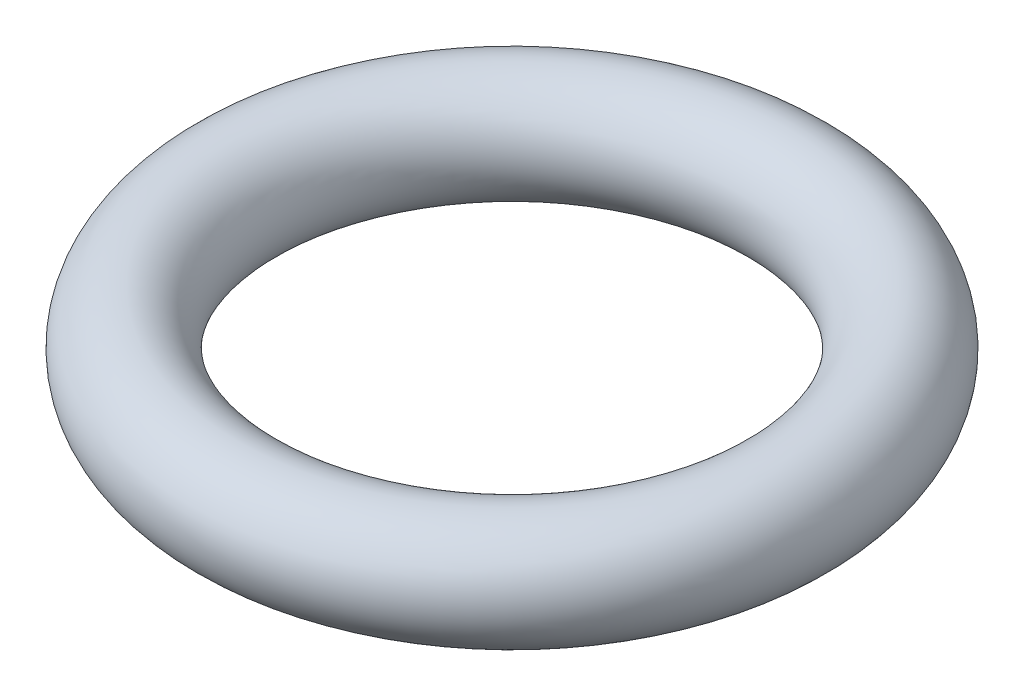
ISO-10303-21;
HEADER;
FILE_DESCRIPTION(('STEP AP214'),'2;1');
FILE_NAME('part.step','',(''),(''),'','','');
FILE_SCHEMA(('AUTOMOTIVE_DESIGN { 1 0 10303 214 1 1 1 1 }'));
ENDSEC;
DATA;
#1=APPLICATION_CONTEXT('core data for automotive mechanical design processes');
#2=APPLICATION_PROTOCOL_DEFINITION('international standard','automotive_design',2000,#1);
#3=PRODUCT_CONTEXT('',#1,'mechanical');
#4=PRODUCT('Part','Part','',(#3));
#5=PRODUCT_RELATED_PRODUCT_CATEGORY('part','',(#4));
#6=PRODUCT_DEFINITION_FORMATION('','',#4);
#7=PRODUCT_DEFINITION_CONTEXT('part definition',#1,'design');
#8=PRODUCT_DEFINITION('design','',#6,#7);
#9=PRODUCT_DEFINITION_SHAPE('','',#8);
#10=(LENGTH_UNIT() NAMED_UNIT(*) SI_UNIT(.MILLI.,.METRE.));
#11=(NAMED_UNIT(*) PLANE_ANGLE_UNIT() SI_UNIT($,.RADIAN.));
#12=(NAMED_UNIT(*) SI_UNIT($,.STERADIAN.) SOLID_ANGLE_UNIT());
#13=UNCERTAINTY_MEASURE_WITH_UNIT(LENGTH_MEASURE(1.E-05),#10,'distance_accuracy_value','');
#14=(GEOMETRIC_REPRESENTATION_CONTEXT(3) GLOBAL_UNCERTAINTY_ASSIGNED_CONTEXT((#13)) GLOBAL_UNIT_ASSIGNED_CONTEXT((#10,
#11,#12)) REPRESENTATION_CONTEXT('',''));
#15=CARTESIAN_POINT('',(0.,0.,0.));
#16=DIRECTION('',(0.,0.,1.));
#17=DIRECTION('',(1.,0.,0.));
#18=AXIS2_PLACEMENT_3D('',#15,#16,#17);
#19=CARTESIAN_POINT('',(0.,0.,0.));
#20=DIRECTION('',(0.,-1.,0.));
#21=DIRECTION('',(0.,0.,-1.));
#22=AXIS2_PLACEMENT_3D('',#19,#20,#21);
#23=TOROIDAL_SURFACE('',#22,1.984375,0.396875);
#24=CARTESIAN_POINT('',(0.,0.,-2.38125));
#25=VERTEX_POINT('',#24);
#26=VERTEX_LOOP('',#25);
#27=FACE_BOUND('',#26,.T.);
#28=ADVANCED_FACE('F27',(#27),#23,.T.);
#29=CLOSED_SHELL('',(#28));
#30=MANIFOLD_SOLID_BREP('B2',#29);
#31=ADVANCED_BREP_SHAPE_REPRESENTATION('',(#18,#30),#14);
#32=SHAPE_DEFINITION_REPRESENTATION(#9,#31);
ENDSEC;
END-ISO-10303-21;
